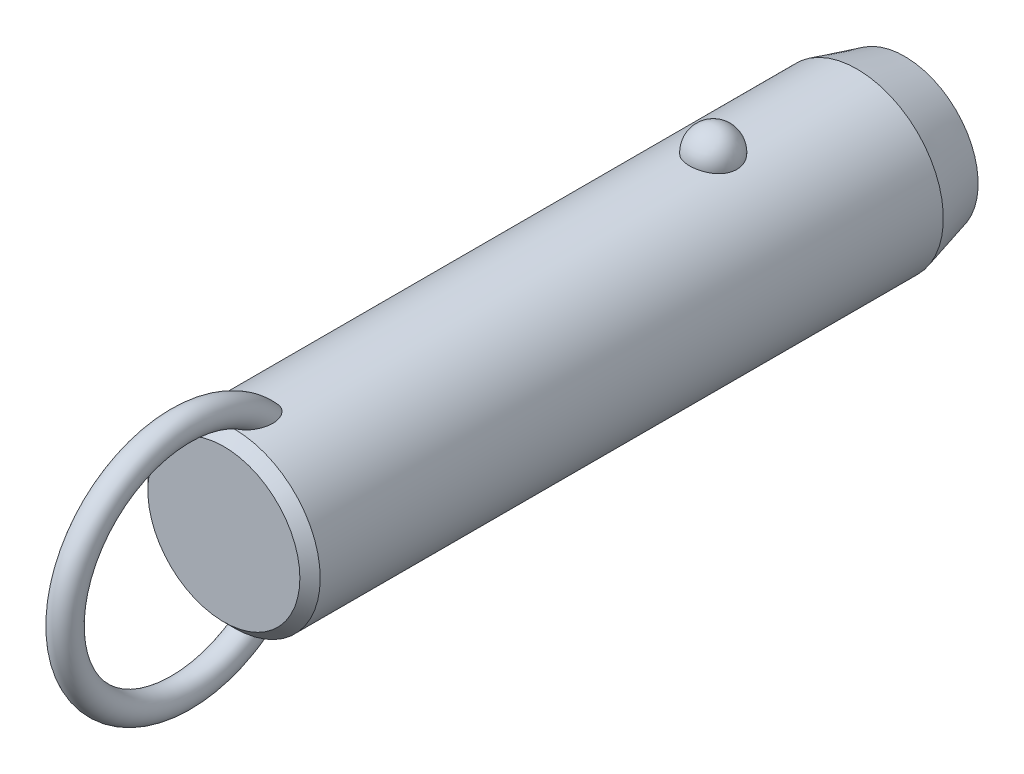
ISO-10303-21;
HEADER;
FILE_DESCRIPTION(('STEP AP214'),'2;1');
FILE_NAME('part.step','',(''),(''),'','','');
FILE_SCHEMA(('AUTOMOTIVE_DESIGN { 1 0 10303 214 1 1 1 1 }'));
ENDSEC;
DATA;
#1=APPLICATION_CONTEXT('core data for automotive mechanical design processes');
#2=APPLICATION_PROTOCOL_DEFINITION('international standard','automotive_design',2000,#1);
#3=PRODUCT_CONTEXT('',#1,'mechanical');
#4=PRODUCT('Part','Part','',(#3));
#5=PRODUCT_RELATED_PRODUCT_CATEGORY('part','',(#4));
#6=PRODUCT_DEFINITION_FORMATION('','',#4);
#7=PRODUCT_DEFINITION_CONTEXT('part definition',#1,'design');
#8=PRODUCT_DEFINITION('design','',#6,#7);
#9=PRODUCT_DEFINITION_SHAPE('','',#8);
#10=(LENGTH_UNIT() NAMED_UNIT(*) SI_UNIT(.MILLI.,.METRE.));
#11=(NAMED_UNIT(*) PLANE_ANGLE_UNIT() SI_UNIT($,.RADIAN.));
#12=(NAMED_UNIT(*) SI_UNIT($,.STERADIAN.) SOLID_ANGLE_UNIT());
#13=UNCERTAINTY_MEASURE_WITH_UNIT(LENGTH_MEASURE(1.E-05),#10,'distance_accuracy_value','');
#14=(GEOMETRIC_REPRESENTATION_CONTEXT(3) GLOBAL_UNCERTAINTY_ASSIGNED_CONTEXT((#13)) GLOBAL_UNIT_ASSIGNED_CONTEXT((#10,
#11,#12)) REPRESENTATION_CONTEXT('',''));
#15=CARTESIAN_POINT('',(0.,0.,0.));
#16=DIRECTION('',(0.,0.,1.));
#17=DIRECTION('',(1.,0.,0.));
#18=AXIS2_PLACEMENT_3D('',#15,#16,#17);
#19=CARTESIAN_POINT('',(0.,0.,55.9));
#20=DIRECTION('',(0.,0.,-1.));
#21=DIRECTION('',(-1.,0.,0.));
#22=AXIS2_PLACEMENT_3D('',#19,#20,#21);
#23=CYLINDRICAL_SURFACE('',#22,12.7);
#24=CARTESIAN_POINT('',(3.46661256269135,12.2177165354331,-3.5));
#25=CARTESIAN_POINT('',(3.4666090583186,12.2177194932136,-3.30432790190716));
#26=CARTESIAN_POINT('',(3.45063567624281,12.2222841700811,-3.10861112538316));
#27=CARTESIAN_POINT('',(3.38712451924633,12.2400345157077,-2.72271899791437));
#28=CARTESIAN_POINT('',(3.33957415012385,12.2532236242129,-2.53254588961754));
#29=CARTESIAN_POINT('',(3.2141234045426,12.286724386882,-2.16324948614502));
#30=CARTESIAN_POINT('',(3.13623639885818,12.3070329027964,-1.98412136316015));
#31=CARTESIAN_POINT('',(2.95205930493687,12.3525018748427,-1.64180592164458));
#32=CARTESIAN_POINT('',(2.84577003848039,12.3776621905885,-1.47861814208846));
#33=CARTESIAN_POINT('',(2.60688050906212,12.4301712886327,-1.17190583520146));
#34=CARTESIAN_POINT('',(2.47415697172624,12.4575299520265,-1.02847897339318));
#35=CARTESIAN_POINT('',(2.18615174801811,12.5112810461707,-0.766177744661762));
#36=CARTESIAN_POINT('',(2.03087002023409,12.5376734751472,-0.64730342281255));
#37=CARTESIAN_POINT('',(1.70237334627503,12.5864761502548,-0.437732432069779));
#38=CARTESIAN_POINT('',(1.52920948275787,12.6088972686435,-0.346958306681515));
#39=CARTESIAN_POINT('',(1.16944170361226,12.6473352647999,-0.195750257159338));
#40=CARTESIAN_POINT('',(0.982839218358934,12.663352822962,-0.135313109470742));
#41=CARTESIAN_POINT('',(0.604961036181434,12.6869706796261,-0.0473241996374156));
#42=CARTESIAN_POINT('',(0.41382314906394,12.6947125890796,-0.0192185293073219));
#43=CARTESIAN_POINT('',(0.0293827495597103,12.7014203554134,0.0051725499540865));
#44=CARTESIAN_POINT('',(-0.163919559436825,12.7003870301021,0.00146092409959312));
#45=CARTESIAN_POINT('',(-0.544374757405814,12.689735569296,-0.0373939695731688));
#46=CARTESIAN_POINT('',(-0.731575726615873,12.6802364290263,-0.0721015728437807));
#47=CARTESIAN_POINT('',(-1.09733277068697,12.6538333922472,-0.171364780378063));
#48=CARTESIAN_POINT('',(-1.27588869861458,12.6369293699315,-0.235920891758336));
#49=CARTESIAN_POINT('',(-1.6204698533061,12.5973946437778,-0.393548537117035));
#50=CARTESIAN_POINT('',(-1.78641865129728,12.5747321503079,-0.486778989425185));
#51=CARTESIAN_POINT('',(-2.10030671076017,12.5261316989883,-0.699110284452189));
#52=CARTESIAN_POINT('',(-2.24824419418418,12.5001934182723,-0.818213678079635));
#53=CARTESIAN_POINT('',(-2.52491489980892,12.4472906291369,-1.08157124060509));
#54=CARTESIAN_POINT('',(-2.65324222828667,12.4203160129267,-1.22624992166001));
#55=CARTESIAN_POINT('',(-2.88410007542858,12.3687509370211,-1.53528325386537));
#56=CARTESIAN_POINT('',(-2.98662883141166,12.3441606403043,-1.69963924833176));
#57=CARTESIAN_POINT('',(-3.16432417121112,12.2998199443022,-2.04548497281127));
#58=CARTESIAN_POINT('',(-3.23917525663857,12.2801261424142,-2.22714424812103));
#59=CARTESIAN_POINT('',(-3.35800573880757,12.248167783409,-2.6009138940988));
#60=CARTESIAN_POINT('',(-3.4019860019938,12.2359030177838,-2.79302397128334));
#61=CARTESIAN_POINT('',(-3.45784812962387,12.2202347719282,-3.18140279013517));
#62=CARTESIAN_POINT('',(-3.46986123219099,12.2167950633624,-3.37765118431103));
#63=CARTESIAN_POINT('',(-3.46186273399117,12.2190638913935,-3.76943689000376));
#64=CARTESIAN_POINT('',(-3.44185196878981,12.2247721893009,-3.96497421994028));
#65=CARTESIAN_POINT('',(-3.37048652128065,12.2446381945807,-4.34881728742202));
#66=CARTESIAN_POINT('',(-3.31928253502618,12.2587552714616,-4.53715319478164));
#67=CARTESIAN_POINT('',(-3.18693461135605,12.2938237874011,-4.90231727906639));
#68=CARTESIAN_POINT('',(-3.1057895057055,12.3147754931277,-5.07914500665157));
#69=CARTESIAN_POINT('',(-2.91506431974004,12.3613125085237,-5.41732059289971));
#70=CARTESIAN_POINT('',(-2.80533587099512,12.3869217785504,-5.57858147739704));
#71=CARTESIAN_POINT('',(-2.560414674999,12.4398525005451,-5.88013283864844));
#72=CARTESIAN_POINT('',(-2.42522099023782,12.4671740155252,-6.02042254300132));
#73=CARTESIAN_POINT('',(-2.1323357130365,12.5205965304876,-6.27662798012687));
#74=CARTESIAN_POINT('',(-1.97456596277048,12.5466928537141,-6.3924554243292));
#75=CARTESIAN_POINT('',(-1.64115839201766,12.5946384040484,-6.59583547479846));
#76=CARTESIAN_POINT('',(-1.46552179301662,12.6164879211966,-6.68339001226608));
#77=CARTESIAN_POINT('',(-1.10356050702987,12.6532533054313,-6.82682153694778));
#78=CARTESIAN_POINT('',(-0.9173913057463,12.6682500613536,-6.8830698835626));
#79=CARTESIAN_POINT('',(-0.537836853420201,12.6900288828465,-6.96386887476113));
#80=CARTESIAN_POINT('',(-0.344452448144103,12.6968119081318,-6.9884232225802));
#81=CARTESIAN_POINT('',(0.0402577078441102,12.7013667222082,-7.00496469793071));
#82=CARTESIAN_POINT('',(0.231556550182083,12.6993008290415,-6.99753844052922));
#83=CARTESIAN_POINT('',(0.610105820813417,12.6867505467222,-6.9516636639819));
#84=CARTESIAN_POINT('',(0.797356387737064,12.6762664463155,-6.913216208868));
#85=CARTESIAN_POINT('',(1.16186657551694,12.6480587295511,-6.80658431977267));
#86=CARTESIAN_POINT('',(1.33915951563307,12.6303611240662,-6.73850666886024));
#87=CARTESIAN_POINT('',(1.67968518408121,12.5896027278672,-6.5745087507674));
#88=CARTESIAN_POINT('',(1.84291705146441,12.5665416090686,-6.47858678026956));
#89=CARTESIAN_POINT('',(2.15340192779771,12.5171072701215,-6.25982455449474));
#90=CARTESIAN_POINT('',(2.30037831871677,12.4906895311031,-6.13660186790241));
#91=CARTESIAN_POINT('',(2.5717412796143,12.4376567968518,-5.86739587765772));
#92=CARTESIAN_POINT('',(2.69612388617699,12.4110417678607,-5.72140858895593));
#93=CARTESIAN_POINT('',(2.92107785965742,12.360051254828,-5.40794137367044));
#94=CARTESIAN_POINT('',(3.02121329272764,12.3357209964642,-5.24014110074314));
#95=CARTESIAN_POINT('',(3.19236291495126,12.2925446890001,-4.88969865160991));
#96=CARTESIAN_POINT('',(3.26338839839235,12.2736965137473,-4.70706226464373));
#97=CARTESIAN_POINT('',(3.36788038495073,12.245404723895,-4.35469510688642));
#98=CARTESIAN_POINT('',(3.40484026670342,12.2351018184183,-4.18605935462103));
#99=CARTESIAN_POINT('',(3.45420764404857,12.2212564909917,-3.84496058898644));
#100=CARTESIAN_POINT('',(3.46661565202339,12.2177139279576,-3.67249765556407));
#101=CARTESIAN_POINT('',(3.46661256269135,12.2177165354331,-3.5));
#102=B_SPLINE_CURVE_WITH_KNOTS('',3,(#24,#25,#26,#27,#28,#29,#30,#31,#32,#33,#34,#35,#36,#37,
#38,#39,#40,#41,#42,#43,#44,#45,#46,#47,#48,#49,#50,#51,#52,#53,#54,#55,#56,#57,#58,#59,#60,#61,
#62,#63,#64,#65,#66,#67,#68,#69,#70,#71,#72,#73,#74,#75,#76,#77,#78,#79,#80,#81,#82,#83,#84,#85,
#86,#87,#88,#89,#90,#91,#92,#93,#94,#95,#96,#97,#98,#99,#100,#101),.UNSPECIFIED.,.T.,.F.,(4,2,2,
2,2,2,2,2,2,2,2,2,2,2,2,2,2,2,2,2,2,2,2,2,2,2,2,2,2,2,2,2,2,2,2,2,2,2,4),(0.,0.586396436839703,
1.17302689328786,1.7593990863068,2.34575431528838,2.93491084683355,3.52406845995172,
4.11158733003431,4.69904375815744,5.2762784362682,5.85345931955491,6.42265312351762,
6.99185659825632,7.56427334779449,8.136746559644,8.71981013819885,9.3029135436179,
9.89247258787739,10.4820150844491,11.0691335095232,11.6562366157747,12.2405256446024,
12.8248374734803,13.412244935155,13.9996740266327,14.5891883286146,15.1786623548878,
15.7609861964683,16.3432419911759,16.9148635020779,17.4864654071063,18.0560241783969,
18.6256177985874,19.2037609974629,19.7820055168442,20.3699810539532,20.957728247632,
21.4746855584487,21.9916320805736),.UNSPECIFIED.);
#103=CARTESIAN_POINT('',(3.46661256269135,12.2177165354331,-3.5));
#104=VERTEX_POINT('',#103);
#105=EDGE_CURVE('E41',#104,#104,#102,.T.);
#106=ORIENTED_EDGE('',*,*,#105,.T.);
#107=EDGE_LOOP('',(#106));
#108=FACE_BOUND('',#107,.T.);
#109=CARTESIAN_POINT('',(0.,0.,67.1));
#110=DIRECTION('',(0.,0.,1.));
#111=DIRECTION('',(1.,0.,0.));
#112=AXIS2_PLACEMENT_3D('',#109,#110,#111);
#113=CIRCLE('',#112,12.7);
#114=CARTESIAN_POINT('',(12.7,0.,67.1));
#115=VERTEX_POINT('',#114);
#116=EDGE_CURVE('E10',#115,#115,#113,.F.);
#117=ORIENTED_EDGE('',*,*,#116,.T.);
#118=EDGE_LOOP('',(#117));
#119=FACE_BOUND('',#118,.T.);
#120=CARTESIAN_POINT('',(-0.548122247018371,-12.6881662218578,60.8432187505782));
#121=CARTESIAN_POINT('',(-0.648865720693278,-12.6838128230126,60.877926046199));
#122=CARTESIAN_POINT('',(-0.7463984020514,-12.6783867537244,60.9220428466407));
#123=CARTESIAN_POINT('',(-0.932125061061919,-12.666091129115,61.0267647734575));
#124=CARTESIAN_POINT('',(-1.02030388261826,-12.6592192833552,61.087396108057));
#125=CARTESIAN_POINT('',(-1.18487740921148,-12.6448747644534,61.221847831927));
#126=CARTESIAN_POINT('',(-1.26134296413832,-12.637406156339,61.2955825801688));
#127=CARTESIAN_POINT('',(-1.4023120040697,-12.6225412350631,61.4536045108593));
#128=CARTESIAN_POINT('',(-1.46681470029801,-12.6151449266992,61.5378923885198));
#129=CARTESIAN_POINT('',(-1.60714786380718,-12.5981718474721,61.7496577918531));
#130=CARTESIAN_POINT('',(-1.67725126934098,-12.588900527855,61.8809624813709));
#131=CARTESIAN_POINT('',(-1.79536591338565,-12.5725964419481,62.1532471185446));
#132=CARTESIAN_POINT('',(-1.84333535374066,-12.5655679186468,62.2942447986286));
#133=CARTESIAN_POINT('',(-1.93422576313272,-12.5519624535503,62.6376455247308));
#134=CARTESIAN_POINT('',(-1.96788773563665,-12.5466298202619,62.8425578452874));
#135=CARTESIAN_POINT('',(-1.9941399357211,-12.542463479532,63.1517600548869));
#136=CARTESIAN_POINT('',(-1.99883864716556,-12.5417153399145,63.2552987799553));
#137=CARTESIAN_POINT('',(-2.00078003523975,-12.5414074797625,63.4624512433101));
#138=CARTESIAN_POINT('',(-1.99802449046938,-12.5418474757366,63.5660649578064));
#139=CARTESIAN_POINT('',(-1.98336733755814,-12.5441750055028,63.8103207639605));
#140=CARTESIAN_POINT('',(-1.96851430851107,-12.5465291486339,63.9507804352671));
#141=CARTESIAN_POINT('',(-1.92707089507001,-12.5529612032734,64.2299607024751));
#142=CARTESIAN_POINT('',(-1.90047458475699,-12.5570399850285,64.3686803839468));
#143=CARTESIAN_POINT('',(-1.83619120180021,-12.5666008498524,64.6434113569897));
#144=CARTESIAN_POINT('',(-1.79850828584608,-12.57208240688,64.7794236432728));
#145=CARTESIAN_POINT('',(-1.71223796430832,-12.5841228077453,65.0478421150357));
#146=CARTESIAN_POINT('',(-1.66365679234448,-12.5906810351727,65.1802503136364));
#147=CARTESIAN_POINT('',(-1.5780450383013,-12.6016176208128,65.3854887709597));
#148=CARTESIAN_POINT('',(-1.54477252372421,-12.6057501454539,65.4599149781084));
#149=CARTESIAN_POINT('',(-1.47424480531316,-12.6141930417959,65.6068393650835));
#150=CARTESIAN_POINT('',(-1.43699041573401,-12.6185033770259,65.6793379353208));
#151=CARTESIAN_POINT('',(-1.35825795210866,-12.6272207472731,65.8218926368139));
#152=CARTESIAN_POINT('',(-1.31678520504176,-12.6316276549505,65.8919517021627));
#153=CARTESIAN_POINT('',(-1.22917793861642,-12.6404532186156,66.0290705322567));
#154=CARTESIAN_POINT('',(-1.18304514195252,-12.6448718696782,66.0961313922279));
#155=CARTESIAN_POINT('',(-1.07246411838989,-12.6547893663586,66.2438741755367));
#156=CARTESIAN_POINT('',(-1.00642239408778,-12.6602600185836,66.3233844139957));
#157=CARTESIAN_POINT('',(-0.864441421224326,-12.6707460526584,66.4731698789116));
#158=CARTESIAN_POINT('',(-0.788516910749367,-12.6757620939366,66.5434585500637));
#159=CARTESIAN_POINT('',(-0.652215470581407,-12.6833591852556,66.6486801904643));
#160=CARTESIAN_POINT('',(-0.594982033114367,-12.6861973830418,66.6876241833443));
#161=CARTESIAN_POINT('',(-0.475269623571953,-12.6912445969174,66.7564899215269));
#162=CARTESIAN_POINT('',(-0.412800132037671,-12.6934547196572,66.7864275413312));
#163=CARTESIAN_POINT('',(-0.295749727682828,-12.6966636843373,66.8297565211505));
#164=CARTESIAN_POINT('',(-0.241949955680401,-12.6978134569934,66.8452188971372));
#165=CARTESIAN_POINT('',(-0.132508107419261,-12.6994261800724,66.8668845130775));
#166=CARTESIAN_POINT('',(-0.0768679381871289,-12.6998898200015,66.8730970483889));
#167=CARTESIAN_POINT('',(0.034769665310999,-12.7000752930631,66.8755838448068));
#168=CARTESIAN_POINT('',(0.0907676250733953,-12.6997954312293,66.8718353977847));
#169=CARTESIAN_POINT('',(0.201283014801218,-12.6985255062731,66.8547883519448));
#170=CARTESIAN_POINT('',(0.255799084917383,-12.6975348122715,66.8414812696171));
#171=CARTESIAN_POINT('',(0.376042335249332,-12.6946091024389,66.8020379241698));
#172=CARTESIAN_POINT('',(0.44095085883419,-12.6924943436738,66.7734492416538));
#173=CARTESIAN_POINT('',(0.565350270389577,-12.6875639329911,66.7063234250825));
#174=CARTESIAN_POINT('',(0.624828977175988,-12.6847467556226,66.6677646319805));
#175=CARTESIAN_POINT('',(0.774116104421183,-12.6767252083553,66.556949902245));
#176=CARTESIAN_POINT('',(0.859449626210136,-12.6711344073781,66.4787605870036));
#177=CARTESIAN_POINT('',(1.01789440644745,-12.6593922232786,66.3109431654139));
#178=CARTESIAN_POINT('',(1.09096902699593,-12.653239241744,66.221282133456));
#179=CARTESIAN_POINT('',(1.22268793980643,-12.6411674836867,66.040265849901));
#180=CARTESIAN_POINT('',(1.28193986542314,-12.6352572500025,65.949345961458));
#181=CARTESIAN_POINT('',(1.39259777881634,-12.6235401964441,65.7627929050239));
#182=CARTESIAN_POINT('',(1.44399707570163,-12.6177334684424,65.6671558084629));
#183=CARTESIAN_POINT('',(1.53972870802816,-12.6064093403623,65.4722738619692));
#184=CARTESIAN_POINT('',(1.58405262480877,-12.6008922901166,65.3730248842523));
#185=CARTESIAN_POINT('',(1.66600705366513,-12.5903187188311,65.1717727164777));
#186=CARTESIAN_POINT('',(1.70363651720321,-12.5852622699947,65.0697690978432));
#187=CARTESIAN_POINT('',(1.77545379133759,-12.5753406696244,64.8543580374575));
#188=CARTESIAN_POINT('',(1.80903453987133,-12.5705328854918,64.740745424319));
#189=CARTESIAN_POINT('',(1.86844163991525,-12.5618400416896,64.5114575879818));
#190=CARTESIAN_POINT('',(1.89426665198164,-12.5579551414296,64.3957820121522));
#191=CARTESIAN_POINT('',(1.9378546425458,-12.5513030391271,64.1630072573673));
#192=CARTESIAN_POINT('',(1.95562640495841,-12.5485346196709,64.0459097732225));
#193=CARTESIAN_POINT('',(1.98264463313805,-12.5442934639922,63.8107473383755));
#194=CARTESIAN_POINT('',(1.99189298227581,-12.5428204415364,63.6926826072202));
#195=CARTESIAN_POINT('',(2.00416068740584,-12.540871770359,63.3806225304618));
#196=CARTESIAN_POINT('',(1.99944433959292,-12.541631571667,63.1862290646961));
#197=CARTESIAN_POINT('',(1.96113755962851,-12.5476846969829,62.8003095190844));
#198=CARTESIAN_POINT('',(1.92758341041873,-12.5529723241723,62.6087801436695));
#199=CARTESIAN_POINT('',(1.8393434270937,-12.5661532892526,62.2822728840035));
#200=CARTESIAN_POINT('',(1.79215440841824,-12.5730485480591,62.1452499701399));
#201=CARTESIAN_POINT('',(1.67676242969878,-12.588958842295,61.8804459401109));
#202=CARTESIAN_POINT('',(1.60859050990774,-12.597970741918,61.7526515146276));
#203=CARTESIAN_POINT('',(1.46583832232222,-12.6152829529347,61.5358006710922));
#204=CARTESIAN_POINT('',(1.39525727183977,-12.6233659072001,61.4441050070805));
#205=CARTESIAN_POINT('',(1.23992594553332,-12.6395676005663,61.2734854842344));
#206=CARTESIAN_POINT('',(1.15517932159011,-12.6476863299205,61.1945583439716));
#207=CARTESIAN_POINT('',(0.971995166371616,-12.6630846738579,61.0526438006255));
#208=CARTESIAN_POINT('',(0.873456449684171,-12.6703572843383,60.9897849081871));
#209=CARTESIAN_POINT('',(0.665847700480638,-12.6829569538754,60.8844870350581));
#210=CARTESIAN_POINT('',(0.556784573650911,-12.688285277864,60.8420347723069));
#211=CARTESIAN_POINT('',(0.347338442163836,-12.6956226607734,60.7844434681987));
#212=CARTESIAN_POINT('',(0.247759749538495,-12.6979816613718,60.7663996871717));
#213=CARTESIAN_POINT('',(0.0470218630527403,-12.7003077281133,60.748600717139));
#214=CARTESIAN_POINT('',(-0.0541350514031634,-12.7002779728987,60.7488212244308));
#215=CARTESIAN_POINT('',(-0.221414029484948,-12.6982482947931,60.7643639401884));
#216=CARTESIAN_POINT('',(-0.288055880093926,-12.6969033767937,60.7746662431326));
#217=CARTESIAN_POINT('',(-0.41959929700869,-12.6932369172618,60.8031348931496));
#218=CARTESIAN_POINT('',(-0.484501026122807,-12.6909154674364,60.8213005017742));
#219=CARTESIAN_POINT('',(-0.548122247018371,-12.6881662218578,60.8432187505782));
#220=B_SPLINE_CURVE_WITH_KNOTS('',3,(#120,#121,#122,#123,#124,#125,#126,#127,#128,#129,#130,
#131,#132,#133,#134,#135,#136,#137,#138,#139,#140,#141,#142,#143,#144,#145,#146,#147,#148,#149,
#150,#151,#152,#153,#154,#155,#156,#157,#158,#159,#160,#161,#162,#163,#164,#165,#166,#167,#168,
#169,#170,#171,#172,#173,#174,#175,#176,#177,#178,#179,#180,#181,#182,#183,#184,#185,#186,#187,
#188,#189,#190,#191,#192,#193,#194,#195,#196,#197,#198,#199,#200,#201,#202,#203,#204,#205,#206,
#207,#208,#209,#210,#211,#212,#213,#214,#215,#216,#217,#218,#219),.UNSPECIFIED.,.T.,.F.,(4,2,2,
2,2,2,2,2,2,2,2,2,2,2,2,2,2,2,2,2,2,2,2,2,2,2,2,2,2,2,2,2,2,2,2,2,2,2,2,2,2,2,2,2,2,2,2,2,2,4),
(0.,0.319642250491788,0.639794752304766,0.95792700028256,1.27608021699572,1.72100165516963,
2.16675988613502,2.78630021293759,3.0970578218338,3.40774128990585,3.83096358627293,
4.25439969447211,4.67767724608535,5.10071330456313,5.34550297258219,5.59024267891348,
5.83467707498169,6.07902143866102,6.38891080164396,6.69834321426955,6.90560910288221,
7.11250749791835,7.27977315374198,7.44687060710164,7.61434932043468,7.78197685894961,
7.99365544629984,8.20579780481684,8.55147335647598,8.89816429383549,9.2237513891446,
9.54961437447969,9.87586224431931,10.202161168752,10.557587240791,10.9130746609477,
11.2681734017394,11.6231936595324,12.2046601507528,12.7853961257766,13.219164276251,
13.6522938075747,13.9989174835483,14.3454519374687,14.6946768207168,15.0436740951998,
15.3457513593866,15.6474266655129,15.8493051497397,16.0511646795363),.UNSPECIFIED.);
#221=CARTESIAN_POINT('',(-0.548122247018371,-12.6881662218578,60.8432187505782));
#222=VERTEX_POINT('',#221);
#223=EDGE_CURVE('E60',#222,#222,#220,.T.);
#224=ORIENTED_EDGE('',*,*,#223,.T.);
#225=EDGE_LOOP('',(#224));
#226=FACE_BOUND('',#225,.T.);
#227=CARTESIAN_POINT('',(-0.548122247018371,12.6881662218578,60.8432187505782));
#228=CARTESIAN_POINT('',(-0.459436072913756,12.6919968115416,60.812673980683));
#229=CARTESIAN_POINT('',(-0.368189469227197,12.6949996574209,60.7893913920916));
#230=CARTESIAN_POINT('',(-0.18302400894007,12.6990186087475,60.7584062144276));
#231=CARTESIAN_POINT('',(-0.0891049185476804,12.7000345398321,60.7507049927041));
#232=CARTESIAN_POINT('',(0.0987147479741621,12.6999636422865,60.7512455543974));
#233=CARTESIAN_POINT('',(0.192615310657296,12.6988761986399,60.759492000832));
#234=CARTESIAN_POINT('',(0.377658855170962,12.6947211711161,60.7915515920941));
#235=CARTESIAN_POINT('',(0.468801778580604,12.6916535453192,60.8153650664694));
#236=CARTESIAN_POINT('',(0.645809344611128,12.6838788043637,60.8774565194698));
#237=CARTESIAN_POINT('',(0.731679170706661,12.6791733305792,60.915720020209));
#238=CARTESIAN_POINT('',(0.896315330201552,12.6686004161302,61.005120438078));
#239=CARTESIAN_POINT('',(0.975080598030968,12.6627328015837,61.0562592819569));
#240=CARTESIAN_POINT('',(1.12963655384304,12.6499161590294,61.1736782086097));
#241=CARTESIAN_POINT('',(1.20478673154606,12.6429194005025,61.2407929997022));
#242=CARTESIAN_POINT('',(1.34448241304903,12.6288282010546,61.3852250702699));
#243=CARTESIAN_POINT('',(1.40902173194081,12.621733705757,61.4625482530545));
#244=CARTESIAN_POINT('',(1.55208211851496,12.6050877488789,61.6592475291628));
#245=CARTESIAN_POINT('',(1.62510490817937,12.5957546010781,61.7826540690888));
#246=CARTESIAN_POINT('',(1.7501904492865,12.5789823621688,62.0397690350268));
#247=CARTESIAN_POINT('',(1.80221377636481,12.5715468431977,62.173496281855));
#248=CARTESIAN_POINT('',(1.90309965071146,12.5567434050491,62.4983516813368));
#249=CARTESIAN_POINT('',(1.94342317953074,12.5504515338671,62.6921611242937));
#250=CARTESIAN_POINT('',(1.99332997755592,12.5426147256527,63.0837881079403));
#251=CARTESIAN_POINT('',(2.00285305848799,12.5410790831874,63.281612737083));
#252=CARTESIAN_POINT('',(1.99678999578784,12.5420407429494,63.6166427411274));
#253=CARTESIAN_POINT('',(1.98794117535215,12.5434564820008,63.7540428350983));
#254=CARTESIAN_POINT('',(1.95865119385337,12.5480641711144,64.0276394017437));
#255=CARTESIAN_POINT('',(1.93820436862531,12.5512569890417,64.1638352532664));
#256=CARTESIAN_POINT('',(1.88647896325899,12.5591352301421,64.4342493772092));
#257=CARTESIAN_POINT('',(1.85518800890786,12.5638223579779,64.5684652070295));
#258=CARTESIAN_POINT('',(1.78217886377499,12.5743868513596,64.8339362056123));
#259=CARTESIAN_POINT('',(1.74046509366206,12.5802637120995,64.9651926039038));
#260=CARTESIAN_POINT('',(1.66024095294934,12.5910571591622,65.1860855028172));
#261=CARTESIAN_POINT('',(1.62434772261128,12.5957535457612,65.2766904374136));
#262=CARTESIAN_POINT('',(1.54709009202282,12.6054762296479,65.4555125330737));
#263=CARTESIAN_POINT('',(1.50572681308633,12.6105024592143,65.5437301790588));
#264=CARTESIAN_POINT('',(1.41728020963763,12.620748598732,65.7169321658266));
#265=CARTESIAN_POINT('',(1.37021377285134,12.625967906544,65.8019251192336));
#266=CARTESIAN_POINT('',(1.26969620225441,12.6364721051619,65.9680072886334));
#267=CARTESIAN_POINT('',(1.21624929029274,12.6417569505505,66.0490990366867));
#268=CARTESIAN_POINT('',(1.10304413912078,12.6521331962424,66.2047027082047));
#269=CARTESIAN_POINT('',(1.04340936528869,12.657226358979,66.2793033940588));
#270=CARTESIAN_POINT('',(0.915919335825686,12.6670906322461,66.421324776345));
#271=CARTESIAN_POINT('',(0.848064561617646,12.6718617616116,66.4887458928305));
#272=CARTESIAN_POINT('',(0.717035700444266,12.67987711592,66.6006247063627));
#273=CARTESIAN_POINT('',(0.655526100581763,12.6832377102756,66.6469970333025));
#274=CARTESIAN_POINT('',(0.525985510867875,12.6892676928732,66.7296195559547));
#275=CARTESIAN_POINT('',(0.457969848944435,12.6919386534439,66.7658927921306));
#276=CARTESIAN_POINT('',(0.334859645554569,12.695691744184,66.8166572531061));
#277=CARTESIAN_POINT('',(0.281116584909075,12.6970073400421,66.8343733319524));
#278=CARTESIAN_POINT('',(0.171425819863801,12.6989609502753,66.8606429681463));
#279=CARTESIAN_POINT('',(0.115480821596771,12.699599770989,66.8692074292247));
#280=CARTESIAN_POINT('',(0.00272618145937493,12.7001251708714,66.8762531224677));
#281=CARTESIAN_POINT('',(-0.0540859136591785,12.7000089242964,66.8746964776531));
#282=CARTESIAN_POINT('',(-0.166544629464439,12.6990328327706,66.8616005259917));
#283=CARTESIAN_POINT('',(-0.222190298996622,12.6981724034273,66.8500533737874));
#284=CARTESIAN_POINT('',(-0.342018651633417,12.695562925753,66.8149128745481));
#285=CARTESIAN_POINT('',(-0.4056068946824,12.6936676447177,66.7893322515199));
#286=CARTESIAN_POINT('',(-0.527815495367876,12.6891754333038,66.7283111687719));
#287=CARTESIAN_POINT('',(-0.586425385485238,12.6865770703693,66.6928505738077));
#288=CARTESIAN_POINT('',(-0.731842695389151,12.6792129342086,66.5914960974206));
#289=CARTESIAN_POINT('',(-0.814709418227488,12.6740767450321,66.5200395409));
#290=CARTESIAN_POINT('',(-0.969101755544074,12.6632083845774,66.3658900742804));
#291=CARTESIAN_POINT('',(-1.04059564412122,12.6574746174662,66.2831668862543));
#292=CARTESIAN_POINT('',(-1.16981116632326,12.6461638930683,66.1158096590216));
#293=CARTESIAN_POINT('',(-1.22811369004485,12.6405994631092,66.0316166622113));
#294=CARTESIAN_POINT('',(-1.33743405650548,12.6295007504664,65.8585791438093));
#295=CARTESIAN_POINT('',(-1.38844577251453,12.6239664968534,65.7697307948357));
#296=CARTESIAN_POINT('',(-1.48400702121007,12.6130898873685,65.588389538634));
#297=CARTESIAN_POINT('',(-1.52854232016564,12.6077479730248,65.4958891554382));
#298=CARTESIAN_POINT('',(-1.61150113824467,12.5974127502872,65.3081607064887));
#299=CARTESIAN_POINT('',(-1.64992317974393,12.5924195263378,65.2129319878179));
#300=CARTESIAN_POINT('',(-1.73468589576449,12.581070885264,64.9828936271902));
#301=CARTESIAN_POINT('',(-1.77831261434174,12.5749388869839,64.8470661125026));
#302=CARTESIAN_POINT('',(-1.85439734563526,12.5639437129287,64.5722128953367));
#303=CARTESIAN_POINT('',(-1.88684994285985,12.5590811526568,64.4331856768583));
#304=CARTESIAN_POINT('',(-1.94008483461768,12.550968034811,64.1530923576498));
#305=CARTESIAN_POINT('',(-1.96088706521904,12.5477147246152,64.0120301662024));
#306=CARTESIAN_POINT('',(-1.99000539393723,12.5431291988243,63.7286689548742));
#307=CARTESIAN_POINT('',(-1.99832911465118,12.5417958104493,63.5863707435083));
#308=CARTESIAN_POINT('',(-2.00166624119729,12.5412674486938,63.2576271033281));
#309=CARTESIAN_POINT('',(-1.99178843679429,12.5428579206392,63.071088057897));
#310=CARTESIAN_POINT('',(-1.94455183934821,12.5502731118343,62.7016240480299));
#311=CARTESIAN_POINT('',(-1.9072403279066,12.5560905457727,62.5186934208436));
#312=CARTESIAN_POINT('',(-1.81330718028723,12.5699462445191,62.2048488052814));
#313=CARTESIAN_POINT('',(-1.76338820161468,12.5771273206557,62.0719105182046));
#314=CARTESIAN_POINT('',(-1.64305018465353,12.593414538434,61.8156813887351));
#315=CARTESIAN_POINT('',(-1.57265346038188,12.6025185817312,61.692380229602));
#316=CARTESIAN_POINT('',(-1.42634956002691,12.6198178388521,61.4835648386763));
#317=CARTESIAN_POINT('',(-1.35423772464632,12.6278405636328,61.3953846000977));
#318=CARTESIAN_POINT('',(-1.19645664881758,12.6437632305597,61.232107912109));
#319=CARTESIAN_POINT('',(-1.11080536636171,12.6516633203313,61.1569944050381));
#320=CARTESIAN_POINT('',(-0.947219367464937,12.6648319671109,61.0378114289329));
#321=CARTESIAN_POINT('',(-0.871624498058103,12.670300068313,60.9905414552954));
#322=CARTESIAN_POINT('',(-0.714161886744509,12.6801492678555,60.9077413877));
#323=CARTESIAN_POINT('',(-0.632295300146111,12.684530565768,60.8722091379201));
#324=CARTESIAN_POINT('',(-0.548122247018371,12.6881662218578,60.8432187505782));
#325=B_SPLINE_CURVE_WITH_KNOTS('',3,(#227,#228,#229,#230,#231,#232,#233,#234,#235,#236,#237,
#238,#239,#240,#241,#242,#243,#244,#245,#246,#247,#248,#249,#250,#251,#252,#253,#254,#255,#256,
#257,#258,#259,#260,#261,#262,#263,#264,#265,#266,#267,#268,#269,#270,#271,#272,#273,#274,#275,
#276,#277,#278,#279,#280,#281,#282,#283,#284,#285,#286,#287,#288,#289,#290,#291,#292,#293,#294,
#295,#296,#297,#298,#299,#300,#301,#302,#303,#304,#305,#306,#307,#308,#309,#310,#311,#312,#313,
#314,#315,#316,#317,#318,#319,#320,#321,#322,#323,#324),.UNSPECIFIED.,.T.,.F.,(4,2,2,2,2,2,2,2,
2,2,2,2,2,2,2,2,2,2,2,2,2,2,2,2,2,2,2,2,2,2,2,2,2,2,2,2,2,2,2,2,2,2,2,2,2,2,2,2,4),(0.,
0.281328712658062,0.562682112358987,0.844117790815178,1.12555942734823,1.40671982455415,
1.68792232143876,1.98972294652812,2.2916988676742,2.72039860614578,3.1498994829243,
3.74084916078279,4.3329529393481,4.7455410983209,5.15833092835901,5.57159335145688,
5.98468079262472,6.27722775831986,6.56971484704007,6.86135609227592,7.15280542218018,
7.43927407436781,7.72572595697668,7.95635862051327,8.18646071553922,8.35559393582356,
8.52452541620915,8.6940894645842,8.86378678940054,9.0683434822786,9.27332014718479,
9.6001041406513,9.92778432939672,10.2350252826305,10.5425229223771,10.8506864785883,
11.15892440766,11.5867893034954,12.0148612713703,12.4421984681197,12.8692745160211,
13.4279365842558,13.9856380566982,14.4107062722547,14.835313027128,15.1765567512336,
15.517351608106,15.7844129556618,16.051425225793),.UNSPECIFIED.);
#326=CARTESIAN_POINT('',(-0.548122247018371,12.6881662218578,60.8432187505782));
#327=VERTEX_POINT('',#326);
#328=EDGE_CURVE('E67',#327,#327,#325,.T.);
#329=ORIENTED_EDGE('',*,*,#328,.T.);
#330=EDGE_LOOP('',(#329));
#331=FACE_BOUND('',#330,.T.);
#332=CARTESIAN_POINT('',(0.,0.,-24.6999999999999));
#333=DIRECTION('',(0.,0.,-1.));
#334=DIRECTION('',(-1.,0.,0.));
#335=AXIS2_PLACEMENT_3D('',#332,#333,#334);
#336=CIRCLE('',#335,12.7);
#337=CARTESIAN_POINT('',(-12.7,0.,-24.6999999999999));
#338=VERTEX_POINT('',#337);
#339=EDGE_CURVE('E57',#338,#338,#336,.F.);
#340=ORIENTED_EDGE('',*,*,#339,.T.);
#341=EDGE_LOOP('',(#340));
#342=FACE_BOUND('',#341,.T.);
#343=ADVANCED_FACE('F37',(#108,#119,#226,#331,#342),#23,.T.);
#344=CARTESIAN_POINT('',(0.,0.,-31.7));
#345=DIRECTION('',(0.,0.,-1.));
#346=DIRECTION('',(-1.,0.,0.));
#347=AXIS2_PLACEMENT_3D('',#344,#345,#346);
#348=PLANE('',#347);
#349=CARTESIAN_POINT('',(0.,0.,-31.7));
#350=DIRECTION('',(0.,0.,-1.));
#351=DIRECTION('',(-1.,0.,0.));
#352=AXIS2_PLACEMENT_3D('',#349,#350,#351);
#353=CIRCLE('',#352,10.8243556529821);
#354=CARTESIAN_POINT('',(-10.8243556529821,0.,-31.7));
#355=VERTEX_POINT('',#354);
#356=EDGE_CURVE('E66',#355,#355,#353,.T.);
#357=ORIENTED_EDGE('',*,*,#356,.T.);
#358=EDGE_LOOP('',(#357));
#359=FACE_BOUND('',#358,.T.);
#360=ADVANCED_FACE('F85',(#359),#348,.T.);
#361=CARTESIAN_POINT('',(0.,0.,-31.7));
#362=DIRECTION('',(0.,0.,1.));
#363=DIRECTION('',(1.,0.,0.));
#364=AXIS2_PLACEMENT_3D('',#361,#362,#363);
#365=CONICAL_SURFACE('',#364,10.8243556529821,0.261799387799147);
#366=ORIENTED_EDGE('',*,*,#339,.F.);
#367=EDGE_LOOP('',(#366));
#368=FACE_BOUND('',#367,.T.);
#369=ORIENTED_EDGE('',*,*,#356,.F.);
#370=EDGE_LOOP('',(#369));
#371=FACE_BOUND('',#370,.T.);
#372=ADVANCED_FACE('F83',(#368,#371),#365,.T.);
#373=CARTESIAN_POINT('',(0.,0.,68.6));
#374=DIRECTION('',(0.,0.,1.));
#375=DIRECTION('',(1.,0.,0.));
#376=AXIS2_PLACEMENT_3D('',#373,#374,#375);
#377=PLANE('',#376);
#378=CARTESIAN_POINT('',(0.,0.,68.6));
#379=DIRECTION('',(0.,0.,1.));
#380=DIRECTION('',(1.,0.,0.));
#381=AXIS2_PLACEMENT_3D('',#378,#379,#380);
#382=CIRCLE('',#381,11.2);
#383=CARTESIAN_POINT('',(11.2,0.,68.6));
#384=VERTEX_POINT('',#383);
#385=EDGE_CURVE('E50',#384,#384,#382,.T.);
#386=ORIENTED_EDGE('',*,*,#385,.T.);
#387=EDGE_LOOP('',(#386));
#388=FACE_BOUND('',#387,.T.);
#389=ADVANCED_FACE('F77',(#388),#377,.T.);
#390=CARTESIAN_POINT('',(0.,0.,74.95));
#391=DIRECTION('',(1.,0.,0.));
#392=DIRECTION('',(0.,0.,-1.));
#393=AXIS2_PLACEMENT_3D('',#390,#391,#392);
#394=TOROIDAL_SURFACE('',#393,17.05,2.);
#395=ORIENTED_EDGE('',*,*,#328,.F.);
#396=EDGE_LOOP('',(#395));
#397=FACE_BOUND('',#396,.T.);
#398=ORIENTED_EDGE('',*,*,#223,.F.);
#399=EDGE_LOOP('',(#398));
#400=FACE_BOUND('',#399,.T.);
#401=ADVANCED_FACE('F73',(#397,#400),#394,.T.);
#402=CARTESIAN_POINT('',(0.,0.,68.6));
#403=DIRECTION('',(0.,0.,-1.));
#404=DIRECTION('',(-1.,0.,0.));
#405=AXIS2_PLACEMENT_3D('',#402,#403,#404);
#406=CONICAL_SURFACE('',#405,11.2,0.785398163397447);
#407=ORIENTED_EDGE('',*,*,#116,.F.);
#408=EDGE_LOOP('',(#407));
#409=FACE_BOUND('',#408,.T.);
#410=ORIENTED_EDGE('',*,*,#385,.F.);
#411=EDGE_LOOP('',(#410));
#412=FACE_BOUND('',#411,.T.);
#413=ADVANCED_FACE('F39',(#409,#412),#406,.T.);
#414=CARTESIAN_POINT('',(0.,12.7,-3.5));
#415=DIRECTION('',(0.,1.,0.));
#416=DIRECTION('',(0.,0.,-1.));
#417=AXIS2_PLACEMENT_3D('',#414,#415,#416);
#418=SPHERICAL_SURFACE('',#417,3.5);
#419=ORIENTED_EDGE('',*,*,#105,.F.);
#420=EDGE_LOOP('',(#419));
#421=FACE_BOUND('',#420,.T.);
#422=ADVANCED_FACE('F79',(#421),#418,.T.);
#423=CLOSED_SHELL('',(#343,#360,#372,#389,#401,#413,#422));
#424=MANIFOLD_SOLID_BREP('B2',#423);
#425=ADVANCED_BREP_SHAPE_REPRESENTATION('',(#18,#424),#14);
#426=SHAPE_DEFINITION_REPRESENTATION(#9,#425);
ENDSEC;
END-ISO-10303-21;
